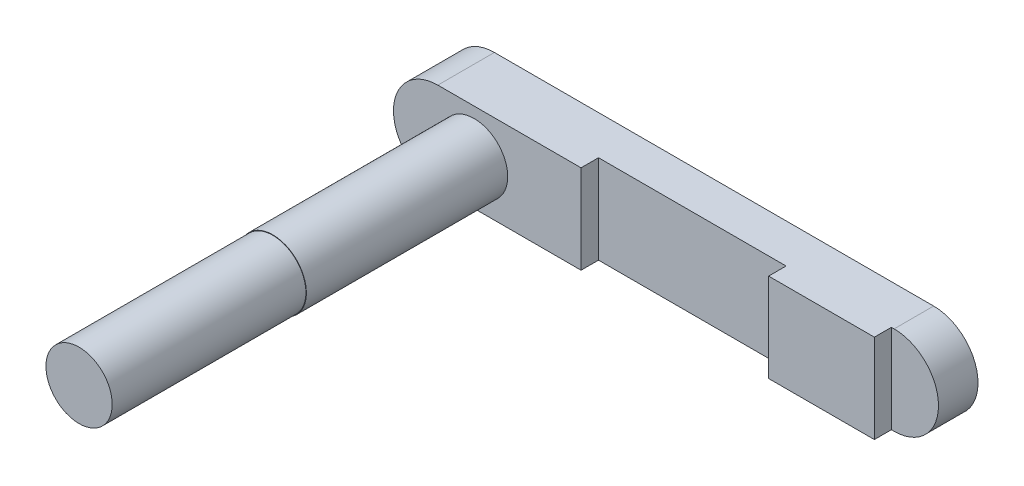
ISO-10303-21;
HEADER;
FILE_DESCRIPTION(('STEP AP214'),'2;1');
FILE_NAME('part.step','',(''),(''),'','','');
FILE_SCHEMA(('AUTOMOTIVE_DESIGN { 1 0 10303 214 1 1 1 1 }'));
ENDSEC;
DATA;
#1=APPLICATION_CONTEXT('core data for automotive mechanical design processes');
#2=APPLICATION_PROTOCOL_DEFINITION('international standard','automotive_design',2000,#1);
#3=PRODUCT_CONTEXT('',#1,'mechanical');
#4=PRODUCT('Part','Part','',(#3));
#5=PRODUCT_RELATED_PRODUCT_CATEGORY('part','',(#4));
#6=PRODUCT_DEFINITION_FORMATION('','',#4);
#7=PRODUCT_DEFINITION_CONTEXT('part definition',#1,'design');
#8=PRODUCT_DEFINITION('design','',#6,#7);
#9=PRODUCT_DEFINITION_SHAPE('','',#8);
#10=(LENGTH_UNIT() NAMED_UNIT(*) SI_UNIT(.MILLI.,.METRE.));
#11=(NAMED_UNIT(*) PLANE_ANGLE_UNIT() SI_UNIT($,.RADIAN.));
#12=(NAMED_UNIT(*) SI_UNIT($,.STERADIAN.) SOLID_ANGLE_UNIT());
#13=UNCERTAINTY_MEASURE_WITH_UNIT(LENGTH_MEASURE(1.E-05),#10,'distance_accuracy_value','');
#14=(GEOMETRIC_REPRESENTATION_CONTEXT(3) GLOBAL_UNCERTAINTY_ASSIGNED_CONTEXT((#13)) GLOBAL_UNIT_ASSIGNED_CONTEXT((#10,
#11,#12)) REPRESENTATION_CONTEXT('',''));
#15=CARTESIAN_POINT('',(0.,0.,0.));
#16=DIRECTION('',(0.,0.,1.));
#17=DIRECTION('',(1.,0.,0.));
#18=AXIS2_PLACEMENT_3D('',#15,#16,#17);
#19=CARTESIAN_POINT('',(5.65785,3.1115,31.67888));
#20=DIRECTION('',(0.,0.,-1.));
#21=DIRECTION('',(-1.,0.,0.));
#22=AXIS2_PLACEMENT_3D('',#19,#20,#21);
#23=CYLINDRICAL_SURFACE('',#22,2.35585);
#24=CARTESIAN_POINT('',(5.65785,3.1115,3.96748));
#25=DIRECTION('',(0.,0.,1.));
#26=DIRECTION('',(1.,0.,0.));
#27=AXIS2_PLACEMENT_3D('',#24,#25,#26);
#28=CIRCLE('',#27,2.35585);
#29=CARTESIAN_POINT('',(3.302,3.1115,3.96748));
#30=VERTEX_POINT('',#29);
#31=EDGE_CURVE('E138',#30,#30,#28,.T.);
#32=CARTESIAN_POINT('',(5.65785,3.1115,18.08988));
#33=DIRECTION('',(0.,0.,1.));
#34=DIRECTION('',(1.,0.,0.));
#35=AXIS2_PLACEMENT_3D('',#32,#33,#34);
#36=CIRCLE('',#35,2.35585);
#37=CARTESIAN_POINT('',(3.302,3.1115,18.08988));
#38=VERTEX_POINT('',#37);
#39=EDGE_CURVE('E39',#38,#38,#36,.T.);
#40=CARTESIAN_POINT('',(3.302,3.1115,3.96748));
#41=CARTESIAN_POINT('',(3.302,3.1115,4.11458833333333));
#42=CARTESIAN_POINT('',(3.302,3.1115,4.26169666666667));
#43=CARTESIAN_POINT('',(3.302,3.1115,4.55591333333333));
#44=CARTESIAN_POINT('',(3.302,3.1115,4.70302166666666));
#45=CARTESIAN_POINT('',(3.302,3.1115,4.99723833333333));
#46=CARTESIAN_POINT('',(3.302,3.1115,5.14434666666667));
#47=CARTESIAN_POINT('',(3.302,3.1115,5.43856333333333));
#48=CARTESIAN_POINT('',(3.302,3.1115,5.58567166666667));
#49=CARTESIAN_POINT('',(3.302,3.1115,5.87988833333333));
#50=CARTESIAN_POINT('',(3.302,3.1115,6.02699666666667));
#51=CARTESIAN_POINT('',(3.302,3.1115,6.32121333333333));
#52=CARTESIAN_POINT('',(3.302,3.1115,6.46832166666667));
#53=CARTESIAN_POINT('',(3.302,3.1115,6.76253833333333));
#54=CARTESIAN_POINT('',(3.302,3.1115,6.90964666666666));
#55=CARTESIAN_POINT('',(3.302,3.1115,7.20386333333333));
#56=CARTESIAN_POINT('',(3.302,3.1115,7.35097166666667));
#57=CARTESIAN_POINT('',(3.302,3.1115,7.64518833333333));
#58=CARTESIAN_POINT('',(3.302,3.1115,7.79229666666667));
#59=CARTESIAN_POINT('',(3.302,3.1115,8.08651333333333));
#60=CARTESIAN_POINT('',(3.302,3.1115,8.23362166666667));
#61=CARTESIAN_POINT('',(3.302,3.1115,8.52783833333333));
#62=CARTESIAN_POINT('',(3.302,3.1115,8.67494666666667));
#63=CARTESIAN_POINT('',(3.302,3.1115,8.96916333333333));
#64=CARTESIAN_POINT('',(3.302,3.1115,9.11627166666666));
#65=CARTESIAN_POINT('',(3.302,3.1115,9.41048833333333));
#66=CARTESIAN_POINT('',(3.302,3.1115,9.55759666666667));
#67=CARTESIAN_POINT('',(3.302,3.1115,9.85181333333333));
#68=CARTESIAN_POINT('',(3.302,3.1115,9.99892166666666));
#69=CARTESIAN_POINT('',(3.302,3.1115,10.2931383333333));
#70=CARTESIAN_POINT('',(3.302,3.1115,10.4402466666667));
#71=CARTESIAN_POINT('',(3.302,3.1115,10.7344633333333));
#72=CARTESIAN_POINT('',(3.302,3.1115,10.8815716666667));
#73=CARTESIAN_POINT('',(3.302,3.1115,11.1757883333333));
#74=CARTESIAN_POINT('',(3.302,3.1115,11.3228966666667));
#75=CARTESIAN_POINT('',(3.302,3.1115,11.6171133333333));
#76=CARTESIAN_POINT('',(3.302,3.1115,11.7642216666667));
#77=CARTESIAN_POINT('',(3.302,3.1115,12.0584383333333));
#78=CARTESIAN_POINT('',(3.302,3.1115,12.2055466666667));
#79=CARTESIAN_POINT('',(3.302,3.1115,12.4997633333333));
#80=CARTESIAN_POINT('',(3.302,3.1115,12.6468716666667));
#81=CARTESIAN_POINT('',(3.302,3.1115,12.9410883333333));
#82=CARTESIAN_POINT('',(3.302,3.1115,13.0881966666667));
#83=CARTESIAN_POINT('',(3.302,3.1115,13.3824133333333));
#84=CARTESIAN_POINT('',(3.302,3.1115,13.5295216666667));
#85=CARTESIAN_POINT('',(3.302,3.1115,13.8237383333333));
#86=CARTESIAN_POINT('',(3.302,3.1115,13.9708466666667));
#87=CARTESIAN_POINT('',(3.302,3.1115,14.2650633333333));
#88=CARTESIAN_POINT('',(3.302,3.1115,14.4121716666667));
#89=CARTESIAN_POINT('',(3.302,3.1115,14.7063883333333));
#90=CARTESIAN_POINT('',(3.302,3.1115,14.8534966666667));
#91=CARTESIAN_POINT('',(3.302,3.1115,15.1477133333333));
#92=CARTESIAN_POINT('',(3.302,3.1115,15.2948216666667));
#93=CARTESIAN_POINT('',(3.302,3.1115,15.5890383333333));
#94=CARTESIAN_POINT('',(3.302,3.1115,15.7361466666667));
#95=CARTESIAN_POINT('',(3.302,3.1115,16.0303633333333));
#96=CARTESIAN_POINT('',(3.302,3.1115,16.1774716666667));
#97=CARTESIAN_POINT('',(3.302,3.1115,16.4716883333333));
#98=CARTESIAN_POINT('',(3.302,3.1115,16.6187966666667));
#99=CARTESIAN_POINT('',(3.302,3.1115,16.9130133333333));
#100=CARTESIAN_POINT('',(3.302,3.1115,17.0601216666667));
#101=CARTESIAN_POINT('',(3.302,3.1115,17.3543383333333));
#102=CARTESIAN_POINT('',(3.302,3.1115,17.5014466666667));
#103=CARTESIAN_POINT('',(3.302,3.1115,17.7956633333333));
#104=CARTESIAN_POINT('',(3.302,3.1115,17.9427716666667));
#105=CARTESIAN_POINT('',(3.302,3.1115,18.08988));
#106=B_SPLINE_CURVE_WITH_KNOTS('',3,(#40,#41,#42,#43,#44,#45,#46,#47,#48,#49,#50,#51,#52,#53,
#54,#55,#56,#57,#58,#59,#60,#61,#62,#63,#64,#65,#66,#67,#68,#69,#70,#71,#72,#73,#74,#75,#76,#77,
#78,#79,#80,#81,#82,#83,#84,#85,#86,#87,#88,#89,#90,#91,#92,#93,#94,#95,#96,#97,#98,#99,#100,
#101,#102,#103,#104,#105),.UNSPECIFIED.,.F.,.F.,(4,2,2,2,2,2,2,2,2,2,2,2,2,2,2,2,2,2,2,2,2,2,2,
2,2,2,2,2,2,2,2,2,4),(0.,0.441324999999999,0.882649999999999,1.323975,1.7653,2.206625,2.64795,
3.089275,3.5306,3.971925,4.41325,4.854575,5.2959,5.737225,6.17855,6.619875,7.0612,7.502525,
7.94385,8.385175,8.8265,9.267825,9.70915,10.150475,10.5918,11.033125,11.47445,11.915775,12.3571,
12.798425,13.23975,13.681075,14.1224),.UNSPECIFIED.);
#107=EDGE_CURVE('BSEAM35',#30,#38,#106,.T.);
#108=ORIENTED_EDGE('',*,*,#31,.T.);
#109=ORIENTED_EDGE('',*,*,#39,.F.);
#110=ORIENTED_EDGE('',*,*,#107,.T.);
#111=ORIENTED_EDGE('',*,*,#107,.F.);
#112=EDGE_LOOP('',(#108,#110,#109,#111));
#113=FACE_BOUND('',#112,.T.);
#114=ADVANCED_FACE('F35',(#113),#23,.T.);
#115=CARTESIAN_POINT('',(3.1115,0.,3.96748));
#116=DIRECTION('',(0.,1.,0.));
#117=DIRECTION('',(-1.,0.,0.));
#118=AXIS2_PLACEMENT_3D('',#115,#116,#117);
#119=PLANE('',#118);
#120=DIRECTION('',(0.,0.,-1.));
#121=VECTOR('',#120,1.);
#122=CARTESIAN_POINT('',(26.3144,0.,12.2220948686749));
#123=LINE('',#122,#121);
#124=CARTESIAN_POINT('',(26.3144,0.,3.96748));
#125=VERTEX_POINT('',#124);
#126=CARTESIAN_POINT('',(26.3144,0.,2.7432));
#127=VERTEX_POINT('',#126);
#128=EDGE_CURVE('E118',#125,#127,#123,.T.);
#129=ORIENTED_EDGE('',*,*,#128,.T.);
#130=DIRECTION('',(-1.,0.,0.));
#131=VECTOR('',#130,1.);
#132=CARTESIAN_POINT('',(26.3144,0.,2.7432));
#133=LINE('',#132,#131);
#134=CARTESIAN_POINT('',(13.1572,0.,2.7432));
#135=VERTEX_POINT('',#134);
#136=EDGE_CURVE('E127',#127,#135,#133,.T.);
#137=ORIENTED_EDGE('',*,*,#136,.T.);
#138=DIRECTION('',(0.,0.,1.));
#139=VECTOR('',#138,1.);
#140=CARTESIAN_POINT('',(13.1572,0.,12.2220948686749));
#141=LINE('',#140,#139);
#142=CARTESIAN_POINT('',(13.1572,0.,3.96748));
#143=VERTEX_POINT('',#142);
#144=EDGE_CURVE('E132',#135,#143,#141,.T.);
#145=ORIENTED_EDGE('',*,*,#144,.T.);
#146=DIRECTION('',(1.,0.,0.));
#147=VECTOR('',#146,1.);
#148=CARTESIAN_POINT('',(3.1115,0.,3.96748));
#149=LINE('',#148,#147);
#150=CARTESIAN_POINT('',(3.1115,0.,3.96748));
#151=VERTEX_POINT('',#150);
#152=EDGE_CURVE('E163',#151,#143,#149,.T.);
#153=ORIENTED_EDGE('',*,*,#152,.F.);
#154=DIRECTION('',(0.,0.,-1.));
#155=VECTOR('',#154,1.);
#156=CARTESIAN_POINT('',(3.1115,0.,3.96748));
#157=LINE('',#156,#155);
#158=CARTESIAN_POINT('',(3.1115,0.,0.));
#159=VERTEX_POINT('',#158);
#160=EDGE_CURVE('E186',#151,#159,#157,.T.);
#161=ORIENTED_EDGE('',*,*,#160,.T.);
#162=DIRECTION('',(1.,0.,0.));
#163=VECTOR('',#162,1.);
#164=CARTESIAN_POINT('',(3.1115,0.,0.));
#165=LINE('',#164,#163);
#166=CARTESIAN_POINT('',(33.9217,0.,0.));
#167=VERTEX_POINT('',#166);
#168=EDGE_CURVE('E173',#159,#167,#165,.T.);
#169=ORIENTED_EDGE('',*,*,#168,.T.);
#170=DIRECTION('',(0.,0.,-1.));
#171=VECTOR('',#170,1.);
#172=CARTESIAN_POINT('',(33.9217,0.,3.96748));
#173=LINE('',#172,#171);
#174=CARTESIAN_POINT('',(33.9217,0.,2.77126869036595));
#175=VERTEX_POINT('',#174);
#176=EDGE_CURVE('E184',#175,#167,#173,.T.);
#177=ORIENTED_EDGE('',*,*,#176,.F.);
#178=DIRECTION('',(-1.,0.,0.));
#179=VECTOR('',#178,1.);
#180=CARTESIAN_POINT('',(43.7046459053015,0.,2.77126869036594));
#181=LINE('',#180,#179);
#182=CARTESIAN_POINT('',(33.7312,0.,2.77126869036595));
#183=VERTEX_POINT('',#182);
#184=EDGE_CURVE('E148',#175,#183,#181,.T.);
#185=ORIENTED_EDGE('',*,*,#184,.T.);
#186=DIRECTION('',(0.,0.,1.));
#187=VECTOR('',#186,1.);
#188=CARTESIAN_POINT('',(33.7312,0.,13.1568404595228));
#189=LINE('',#188,#187);
#190=CARTESIAN_POINT('',(33.7312,0.,3.96748));
#191=VERTEX_POINT('',#190);
#192=EDGE_CURVE('E151',#183,#191,#189,.T.);
#193=ORIENTED_EDGE('',*,*,#192,.T.);
#194=EDGE_CURVE('E137',#125,#191,#149,.T.);
#195=ORIENTED_EDGE('',*,*,#194,.F.);
#196=EDGE_LOOP('',(#129,#137,#145,#153,#161,#169,#177,#185,#193,#195));
#197=FACE_BOUND('',#196,.T.);
#198=ADVANCED_FACE('F135',(#197),#119,.F.);
#199=CARTESIAN_POINT('',(3.1115,6.223,3.96748));
#200=DIRECTION('',(0.,-1.,0.));
#201=DIRECTION('',(1.,0.,0.));
#202=AXIS2_PLACEMENT_3D('',#199,#200,#201);
#203=PLANE('',#202);
#204=DIRECTION('',(0.,0.,-1.));
#205=VECTOR('',#204,1.);
#206=CARTESIAN_POINT('',(26.3144,6.223,3.96748));
#207=LINE('',#206,#205);
#208=CARTESIAN_POINT('',(26.3144,6.223,3.96748));
#209=VERTEX_POINT('',#208);
#210=CARTESIAN_POINT('',(26.3144,6.223,2.7432));
#211=VERTEX_POINT('',#210);
#212=EDGE_CURVE('E121',#209,#211,#207,.T.);
#213=ORIENTED_EDGE('',*,*,#212,.F.);
#214=DIRECTION('',(-1.,0.,0.));
#215=VECTOR('',#214,1.);
#216=CARTESIAN_POINT('',(3.1115,6.223,3.96748));
#217=LINE('',#216,#215);
#218=CARTESIAN_POINT('',(33.7312,6.223,3.96748));
#219=VERTEX_POINT('',#218);
#220=EDGE_CURVE('E167',#219,#209,#217,.T.);
#221=ORIENTED_EDGE('',*,*,#220,.F.);
#222=DIRECTION('',(0.,0.,1.));
#223=VECTOR('',#222,1.);
#224=CARTESIAN_POINT('',(33.7312,6.223,3.96748));
#225=LINE('',#224,#223);
#226=CARTESIAN_POINT('',(33.7312,6.223,2.77126869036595));
#227=VERTEX_POINT('',#226);
#228=EDGE_CURVE('E59',#227,#219,#225,.T.);
#229=ORIENTED_EDGE('',*,*,#228,.F.);
#230=DIRECTION('',(-1.,0.,0.));
#231=VECTOR('',#230,1.);
#232=CARTESIAN_POINT('',(3.1115,6.223,2.77126869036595));
#233=LINE('',#232,#231);
#234=CARTESIAN_POINT('',(33.9217,6.223,2.77126869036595));
#235=VERTEX_POINT('',#234);
#236=EDGE_CURVE('E191',#235,#227,#233,.T.);
#237=ORIENTED_EDGE('',*,*,#236,.F.);
#238=DIRECTION('',(0.,0.,-1.));
#239=VECTOR('',#238,1.);
#240=CARTESIAN_POINT('',(33.9217,6.223,3.96748));
#241=LINE('',#240,#239);
#242=CARTESIAN_POINT('',(33.9217,6.223,0.));
#243=VERTEX_POINT('',#242);
#244=EDGE_CURVE('E182',#235,#243,#241,.T.);
#245=ORIENTED_EDGE('',*,*,#244,.T.);
#246=DIRECTION('',(-1.,0.,0.));
#247=VECTOR('',#246,1.);
#248=CARTESIAN_POINT('',(3.1115,6.223,0.));
#249=LINE('',#248,#247);
#250=CARTESIAN_POINT('',(3.1115,6.223,0.));
#251=VERTEX_POINT('',#250);
#252=EDGE_CURVE('E162',#243,#251,#249,.T.);
#253=ORIENTED_EDGE('',*,*,#252,.T.);
#254=DIRECTION('',(0.,0.,-1.));
#255=VECTOR('',#254,1.);
#256=CARTESIAN_POINT('',(3.1115,6.223,3.96748));
#257=LINE('',#256,#255);
#258=CARTESIAN_POINT('',(3.1115,6.223,3.96748));
#259=VERTEX_POINT('',#258);
#260=EDGE_CURVE('E170',#259,#251,#257,.T.);
#261=ORIENTED_EDGE('',*,*,#260,.F.);
#262=CARTESIAN_POINT('',(13.1572,6.223,3.96748));
#263=VERTEX_POINT('',#262);
#264=EDGE_CURVE('E166',#263,#259,#217,.T.);
#265=ORIENTED_EDGE('',*,*,#264,.F.);
#266=DIRECTION('',(0.,0.,1.));
#267=VECTOR('',#266,1.);
#268=CARTESIAN_POINT('',(13.1572,6.223,3.96748));
#269=LINE('',#268,#267);
#270=CARTESIAN_POINT('',(13.1572,6.223,2.7432));
#271=VERTEX_POINT('',#270);
#272=EDGE_CURVE('E51',#271,#263,#269,.T.);
#273=ORIENTED_EDGE('',*,*,#272,.F.);
#274=DIRECTION('',(-1.,0.,0.));
#275=VECTOR('',#274,1.);
#276=CARTESIAN_POINT('',(3.1115,6.223,2.7432));
#277=LINE('',#276,#275);
#278=EDGE_CURVE('E11',#211,#271,#277,.T.);
#279=ORIENTED_EDGE('',*,*,#278,.F.);
#280=EDGE_LOOP('',(#213,#221,#229,#237,#245,#253,#261,#265,#273,#279));
#281=FACE_BOUND('',#280,.T.);
#282=ADVANCED_FACE('F199',(#281),#203,.F.);
#283=CARTESIAN_POINT('',(3.1115,3.1115,3.96748));
#284=DIRECTION('',(0.,0.,1.));
#285=DIRECTION('',(1.,0.,0.));
#286=AXIS2_PLACEMENT_3D('',#283,#284,#285);
#287=PLANE('',#286);
#288=ORIENTED_EDGE('',*,*,#220,.T.);
#289=DIRECTION('',(0.,-1.,0.));
#290=VECTOR('',#289,1.);
#291=CARTESIAN_POINT('',(26.3144,3.1115,3.96748));
#292=LINE('',#291,#290);
#293=EDGE_CURVE('E44',#209,#125,#292,.T.);
#294=ORIENTED_EDGE('',*,*,#293,.T.);
#295=ORIENTED_EDGE('',*,*,#194,.T.);
#296=DIRECTION('',(0.,1.,0.));
#297=VECTOR('',#296,1.);
#298=CARTESIAN_POINT('',(33.7312,3.1115,3.96748));
#299=LINE('',#298,#297);
#300=EDGE_CURVE('E189',#191,#219,#299,.T.);
#301=ORIENTED_EDGE('',*,*,#300,.T.);
#302=EDGE_LOOP('',(#288,#294,#295,#301));
#303=FACE_BOUND('',#302,.T.);
#304=ADVANCED_FACE('F196',(#303),#287,.T.);
#305=ORIENTED_EDGE('',*,*,#31,.F.);
#306=EDGE_LOOP('',(#305));
#307=FACE_BOUND('',#306,.T.);
#308=ORIENTED_EDGE('',*,*,#152,.T.);
#309=DIRECTION('',(0.,1.,0.));
#310=VECTOR('',#309,1.);
#311=CARTESIAN_POINT('',(13.1572,3.1115,3.96748));
#312=LINE('',#311,#310);
#313=EDGE_CURVE('E193',#143,#263,#312,.T.);
#314=ORIENTED_EDGE('',*,*,#313,.T.);
#315=ORIENTED_EDGE('',*,*,#264,.T.);
#316=CARTESIAN_POINT('',(3.1115,3.1115,3.96748));
#317=DIRECTION('',(0.,0.,1.));
#318=DIRECTION('',(1.,0.,0.));
#319=AXIS2_PLACEMENT_3D('',#316,#317,#318);
#320=CIRCLE('',#319,3.1115);
#321=EDGE_CURVE('E159',#259,#151,#320,.T.);
#322=ORIENTED_EDGE('',*,*,#321,.T.);
#323=EDGE_LOOP('',(#308,#314,#315,#322));
#324=FACE_BOUND('',#323,.T.);
#325=ADVANCED_FACE('F203',(#307,#324),#287,.T.);
#326=CARTESIAN_POINT('',(33.9217,3.1115,3.96748));
#327=DIRECTION('',(0.,0.,-1.));
#328=DIRECTION('',(-1.,0.,0.));
#329=AXIS2_PLACEMENT_3D('',#326,#327,#328);
#330=CYLINDRICAL_SURFACE('',#329,3.1115);
#331=CARTESIAN_POINT('',(33.9217,3.1115,2.77126869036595));
#332=DIRECTION('',(0.,0.,1.));
#333=DIRECTION('',(1.,0.,0.));
#334=AXIS2_PLACEMENT_3D('',#331,#332,#333);
#335=CIRCLE('',#334,3.1115);
#336=EDGE_CURVE('E156',#175,#235,#335,.T.);
#337=ORIENTED_EDGE('',*,*,#336,.F.);
#338=ORIENTED_EDGE('',*,*,#176,.T.);
#339=CARTESIAN_POINT('',(33.9217,3.1115,0.));
#340=DIRECTION('',(0.,0.,1.));
#341=DIRECTION('',(1.,0.,0.));
#342=AXIS2_PLACEMENT_3D('',#339,#340,#341);
#343=CIRCLE('',#342,3.1115);
#344=EDGE_CURVE('E176',#167,#243,#343,.T.);
#345=ORIENTED_EDGE('',*,*,#344,.T.);
#346=ORIENTED_EDGE('',*,*,#244,.F.);
#347=EDGE_LOOP('',(#337,#338,#345,#346));
#348=FACE_BOUND('',#347,.T.);
#349=ADVANCED_FACE('F217',(#348),#330,.T.);
#350=CARTESIAN_POINT('',(3.1115,3.1115,3.96748));
#351=DIRECTION('',(0.,0.,-1.));
#352=DIRECTION('',(-1.,0.,0.));
#353=AXIS2_PLACEMENT_3D('',#350,#351,#352);
#354=CYLINDRICAL_SURFACE('',#353,3.1115);
#355=CARTESIAN_POINT('',(3.1115,3.1115,0.));
#356=DIRECTION('',(0.,0.,1.));
#357=DIRECTION('',(1.,0.,0.));
#358=AXIS2_PLACEMENT_3D('',#355,#356,#357);
#359=CIRCLE('',#358,3.1115);
#360=EDGE_CURVE('E158',#251,#159,#359,.T.);
#361=ORIENTED_EDGE('',*,*,#360,.T.);
#362=ORIENTED_EDGE('',*,*,#160,.F.);
#363=ORIENTED_EDGE('',*,*,#321,.F.);
#364=ORIENTED_EDGE('',*,*,#260,.T.);
#365=EDGE_LOOP('',(#361,#362,#363,#364));
#366=FACE_BOUND('',#365,.T.);
#367=ADVANCED_FACE('F37',(#366),#354,.T.);
#368=CARTESIAN_POINT('',(3.1115,3.1115,0.));
#369=DIRECTION('',(0.,0.,1.));
#370=DIRECTION('',(1.,0.,0.));
#371=AXIS2_PLACEMENT_3D('',#368,#369,#370);
#372=PLANE('',#371);
#373=ORIENTED_EDGE('',*,*,#360,.F.);
#374=ORIENTED_EDGE('',*,*,#252,.F.);
#375=ORIENTED_EDGE('',*,*,#344,.F.);
#376=ORIENTED_EDGE('',*,*,#168,.F.);
#377=EDGE_LOOP('',(#373,#374,#375,#376));
#378=FACE_BOUND('',#377,.T.);
#379=ADVANCED_FACE('F213',(#378),#372,.F.);
#380=CARTESIAN_POINT('',(43.7046459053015,9.04748,2.77126869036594));
#381=DIRECTION('',(0.,0.,1.));
#382=DIRECTION('',(1.,0.,0.));
#383=AXIS2_PLACEMENT_3D('',#380,#381,#382);
#384=PLANE('',#383);
#385=ORIENTED_EDGE('',*,*,#336,.T.);
#386=ORIENTED_EDGE('',*,*,#236,.T.);
#387=DIRECTION('',(0.,-1.,0.));
#388=VECTOR('',#387,1.);
#389=CARTESIAN_POINT('',(33.7312,9.04748,2.77126869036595));
#390=LINE('',#389,#388);
#391=EDGE_CURVE('E153',#227,#183,#390,.T.);
#392=ORIENTED_EDGE('',*,*,#391,.T.);
#393=ORIENTED_EDGE('',*,*,#184,.F.);
#394=EDGE_LOOP('',(#385,#386,#392,#393));
#395=FACE_BOUND('',#394,.T.);
#396=ADVANCED_FACE('F220',(#395),#384,.T.);
#397=CARTESIAN_POINT('',(33.7312,9.04748,13.1568404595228));
#398=DIRECTION('',(1.,0.,0.));
#399=DIRECTION('',(0.,0.,-1.));
#400=AXIS2_PLACEMENT_3D('',#397,#398,#399);
#401=PLANE('',#400);
#402=ORIENTED_EDGE('',*,*,#228,.T.);
#403=ORIENTED_EDGE('',*,*,#300,.F.);
#404=ORIENTED_EDGE('',*,*,#192,.F.);
#405=ORIENTED_EDGE('',*,*,#391,.F.);
#406=EDGE_LOOP('',(#402,#403,#404,#405));
#407=FACE_BOUND('',#406,.T.);
#408=ADVANCED_FACE('F222',(#407),#401,.T.);
#409=CARTESIAN_POINT('',(26.3144,9.04748,2.7432));
#410=DIRECTION('',(0.,0.,1.));
#411=DIRECTION('',(1.,0.,0.));
#412=AXIS2_PLACEMENT_3D('',#409,#410,#411);
#413=PLANE('',#412);
#414=ORIENTED_EDGE('',*,*,#278,.T.);
#415=DIRECTION('',(0.,-1.,0.));
#416=VECTOR('',#415,1.);
#417=CARTESIAN_POINT('',(13.1572,9.04748,2.7432));
#418=LINE('',#417,#416);
#419=EDGE_CURVE('E124',#271,#135,#418,.T.);
#420=ORIENTED_EDGE('',*,*,#419,.T.);
#421=ORIENTED_EDGE('',*,*,#136,.F.);
#422=DIRECTION('',(0.,-1.,0.));
#423=VECTOR('',#422,1.);
#424=CARTESIAN_POINT('',(26.3144,9.04748,2.7432));
#425=LINE('',#424,#423);
#426=EDGE_CURVE('E114',#211,#127,#425,.T.);
#427=ORIENTED_EDGE('',*,*,#426,.F.);
#428=EDGE_LOOP('',(#414,#420,#421,#427));
#429=FACE_BOUND('',#428,.T.);
#430=ADVANCED_FACE('F128',(#429),#413,.T.);
#431=CARTESIAN_POINT('',(26.3144,9.04748,12.2220948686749));
#432=DIRECTION('',(-1.,0.,0.));
#433=DIRECTION('',(0.,0.,1.));
#434=AXIS2_PLACEMENT_3D('',#431,#432,#433);
#435=PLANE('',#434);
#436=ORIENTED_EDGE('',*,*,#212,.T.);
#437=ORIENTED_EDGE('',*,*,#426,.T.);
#438=ORIENTED_EDGE('',*,*,#128,.F.);
#439=ORIENTED_EDGE('',*,*,#293,.F.);
#440=EDGE_LOOP('',(#436,#437,#438,#439));
#441=FACE_BOUND('',#440,.T.);
#442=ADVANCED_FACE('F116',(#441),#435,.T.);
#443=CARTESIAN_POINT('',(13.1572,9.04748,12.2220948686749));
#444=DIRECTION('',(1.,0.,0.));
#445=DIRECTION('',(0.,0.,-1.));
#446=AXIS2_PLACEMENT_3D('',#443,#444,#445);
#447=PLANE('',#446);
#448=ORIENTED_EDGE('',*,*,#272,.T.);
#449=ORIENTED_EDGE('',*,*,#313,.F.);
#450=ORIENTED_EDGE('',*,*,#144,.F.);
#451=ORIENTED_EDGE('',*,*,#419,.F.);
#452=EDGE_LOOP('',(#448,#449,#450,#451));
#453=FACE_BOUND('',#452,.T.);
#454=ADVANCED_FACE('F201',(#453),#447,.T.);
#455=CARTESIAN_POINT('',(5.65785,3.1115,18.08988));
#456=DIRECTION('',(0.,0.,1.));
#457=DIRECTION('',(1.,0.,0.));
#458=AXIS2_PLACEMENT_3D('',#455,#456,#457);
#459=PLANE('',#458);
#460=CARTESIAN_POINT('',(5.65785,3.1115,18.08988));
#461=DIRECTION('',(0.,0.,1.));
#462=DIRECTION('',(1.,0.,0.));
#463=AXIS2_PLACEMENT_3D('',#460,#461,#462);
#464=CIRCLE('',#463,2.3241);
#465=CARTESIAN_POINT('',(7.98195,3.1115,18.08988));
#466=VERTEX_POINT('',#465);
#467=EDGE_CURVE('E362',#466,#466,#464,.T.);
#468=ORIENTED_EDGE('',*,*,#467,.F.);
#469=EDGE_LOOP('',(#468));
#470=FACE_BOUND('',#469,.T.);
#471=ORIENTED_EDGE('',*,*,#39,.T.);
#472=EDGE_LOOP('',(#471));
#473=FACE_BOUND('',#472,.T.);
#474=ADVANCED_FACE('F244',(#470,#473),#459,.T.);
#475=CARTESIAN_POINT('',(5.65785,3.1115,18.08988));
#476=DIRECTION('',(0.,0.,1.));
#477=DIRECTION('',(1.,0.,0.));
#478=AXIS2_PLACEMENT_3D('',#475,#476,#477);
#479=CYLINDRICAL_SURFACE('',#478,2.3241);
#480=ORIENTED_EDGE('',*,*,#467,.T.);
#481=EDGE_LOOP('',(#480));
#482=FACE_BOUND('',#481,.T.);
#483=CARTESIAN_POINT('',(5.65785,3.1115,31.67888));
#484=DIRECTION('',(0.,0.,1.));
#485=DIRECTION('',(1.,0.,0.));
#486=AXIS2_PLACEMENT_3D('',#483,#484,#485);
#487=CIRCLE('',#486,2.3241);
#488=CARTESIAN_POINT('',(7.98195,3.1115,31.67888));
#489=VERTEX_POINT('',#488);
#490=EDGE_CURVE('E360',#489,#489,#487,.T.);
#491=ORIENTED_EDGE('',*,*,#490,.F.);
#492=EDGE_LOOP('',(#491));
#493=FACE_BOUND('',#492,.T.);
#494=ADVANCED_FACE('F261',(#482,#493),#479,.T.);
#495=CARTESIAN_POINT('',(5.65785,3.1115,31.67888));
#496=DIRECTION('',(0.,0.,1.));
#497=DIRECTION('',(1.,0.,0.));
#498=AXIS2_PLACEMENT_3D('',#495,#496,#497);
#499=PLANE('',#498);
#500=ORIENTED_EDGE('',*,*,#490,.T.);
#501=EDGE_LOOP('',(#500));
#502=FACE_BOUND('',#501,.T.);
#503=ADVANCED_FACE('F241',(#502),#499,.T.);
#504=CLOSED_SHELL('',(#114,#198,#282,#304,#325,#349,#367,#379,#396,#408,#430,#442,#454,#474,
#494,#503));
#505=MANIFOLD_SOLID_BREP('B2',#504);
#506=ADVANCED_BREP_SHAPE_REPRESENTATION('',(#18,#505),#14);
#507=SHAPE_DEFINITION_REPRESENTATION(#9,#506);
ENDSEC;
END-ISO-10303-21;
